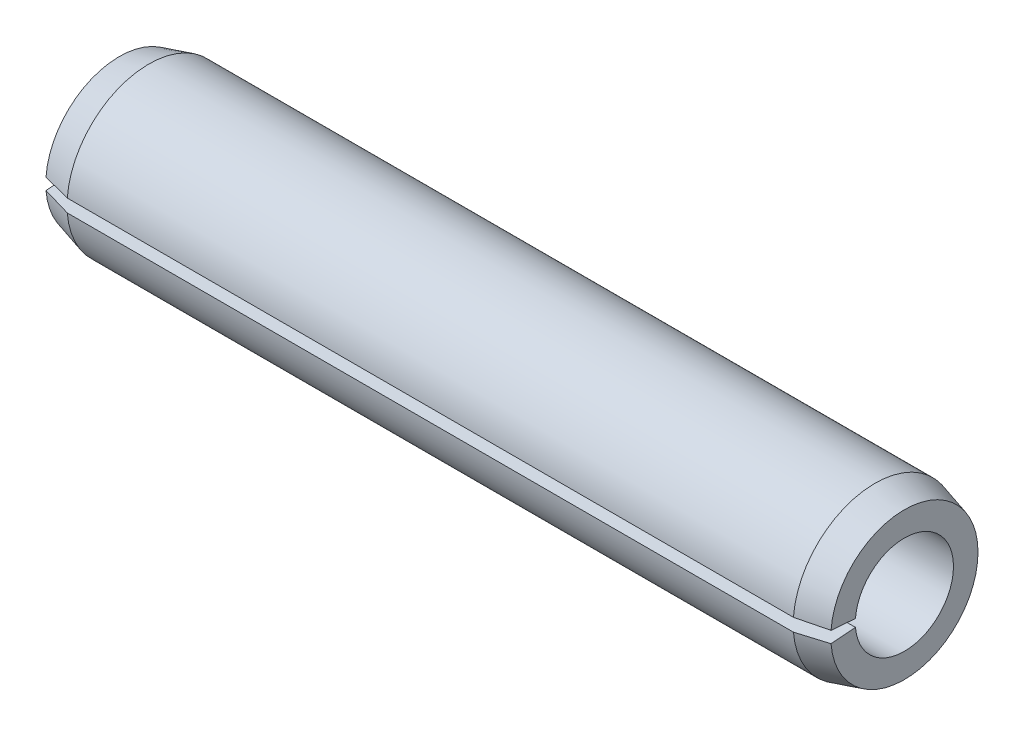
ISO-10303-21;
HEADER;
FILE_DESCRIPTION(('STEP AP214'),'2;1');
FILE_NAME('part.step','',(''),(''),'','','');
FILE_SCHEMA(('AUTOMOTIVE_DESIGN { 1 0 10303 214 1 1 1 1 }'));
ENDSEC;
DATA;
#1=APPLICATION_CONTEXT('core data for automotive mechanical design processes');
#2=APPLICATION_PROTOCOL_DEFINITION('international standard','automotive_design',2000,#1);
#3=PRODUCT_CONTEXT('',#1,'mechanical');
#4=PRODUCT('Part','Part','',(#3));
#5=PRODUCT_RELATED_PRODUCT_CATEGORY('part','',(#4));
#6=PRODUCT_DEFINITION_FORMATION('','',#4);
#7=PRODUCT_DEFINITION_CONTEXT('part definition',#1,'design');
#8=PRODUCT_DEFINITION('design','',#6,#7);
#9=PRODUCT_DEFINITION_SHAPE('','',#8);
#10=(LENGTH_UNIT() NAMED_UNIT(*) SI_UNIT(.MILLI.,.METRE.));
#11=(NAMED_UNIT(*) PLANE_ANGLE_UNIT() SI_UNIT($,.RADIAN.));
#12=(NAMED_UNIT(*) SI_UNIT($,.STERADIAN.) SOLID_ANGLE_UNIT());
#13=UNCERTAINTY_MEASURE_WITH_UNIT(LENGTH_MEASURE(1.E-05),#10,'distance_accuracy_value','');
#14=(GEOMETRIC_REPRESENTATION_CONTEXT(3) GLOBAL_UNCERTAINTY_ASSIGNED_CONTEXT((#13)) GLOBAL_UNIT_ASSIGNED_CONTEXT((#10,
#11,#12)) REPRESENTATION_CONTEXT('',''));
#15=CARTESIAN_POINT('',(0.,0.,0.));
#16=DIRECTION('',(0.,0.,1.));
#17=DIRECTION('',(1.,0.,0.));
#18=AXIS2_PLACEMENT_3D('',#15,#16,#17);
#19=CARTESIAN_POINT('',(0.,2.25,0.));
#20=DIRECTION('',(1.,0.,0.));
#21=DIRECTION('',(0.,0.,-1.00000000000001));
#22=AXIS2_PLACEMENT_3D('',#19,#20,#21);
#23=PLANE('',#22);
#24=DIRECTION('',(0.,0.0784590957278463,0.996917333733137));
#25=VECTOR('',#24,1.);
#26=CARTESIAN_POINT('',(0.,0.,0.));
#27=LINE('',#26,#25);
#28=CARTESIAN_POINT('',(0.,0.117688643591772,1.4953760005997));
#29=VERTEX_POINT('',#28);
#30=CARTESIAN_POINT('',(0.,0.176532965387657,2.24306400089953));
#31=VERTEX_POINT('',#30);
#32=EDGE_CURVE('E83',#29,#31,#27,.T.);
#33=ORIENTED_EDGE('',*,*,#32,.T.);
#34=CARTESIAN_POINT('',(0.,0.,0.));
#35=DIRECTION('',(-1.,0.,0.));
#36=DIRECTION('',(0.,0.,1.00000000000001));
#37=AXIS2_PLACEMENT_3D('',#34,#35,#36);
#38=CIRCLE('',#37,2.25);
#39=CARTESIAN_POINT('',(0.,-0.176532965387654,2.24306400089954));
#40=VERTEX_POINT('',#39);
#41=EDGE_CURVE('E101',#31,#40,#38,.T.);
#42=ORIENTED_EDGE('',*,*,#41,.T.);
#43=DIRECTION('',(0.,-0.078459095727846,0.996917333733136));
#44=VECTOR('',#43,1.);
#45=CARTESIAN_POINT('',(0.,0.,0.));
#46=LINE('',#45,#44);
#47=CARTESIAN_POINT('',(0.,-0.117688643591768,1.49537600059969));
#48=VERTEX_POINT('',#47);
#49=EDGE_CURVE('E55',#48,#40,#46,.T.);
#50=ORIENTED_EDGE('',*,*,#49,.F.);
#51=CARTESIAN_POINT('',(0.,0.,0.));
#52=DIRECTION('',(-1.,0.,0.));
#53=DIRECTION('',(0.,0.,1.00000000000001));
#54=AXIS2_PLACEMENT_3D('',#51,#52,#53);
#55=CIRCLE('',#54,1.5);
#56=EDGE_CURVE('E98',#29,#48,#55,.T.);
#57=ORIENTED_EDGE('',*,*,#56,.F.);
#58=EDGE_LOOP('',(#33,#42,#50,#57));
#59=FACE_BOUND('',#58,.T.);
#60=ADVANCED_FACE('F34',(#59),#23,.F.);
#61=CARTESIAN_POINT('',(-9.52499999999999,0.,-2.28983498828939E-13));
#62=DIRECTION('',(-1.,0.,0.));
#63=DIRECTION('',(0.,0.,1.00000000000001));
#64=AXIS2_PLACEMENT_3D('',#61,#62,#63);
#65=CYLINDRICAL_SURFACE('',#64,1.5);
#66=DIRECTION('',(-1.,0.,0.));
#67=VECTOR('',#66,1.);
#68=CARTESIAN_POINT('',(-9.52499999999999,0.117688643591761,1.49537600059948));
#69=LINE('',#68,#67);
#70=CARTESIAN_POINT('',(24.,0.117688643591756,1.49537600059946));
#71=VERTEX_POINT('',#70);
#72=EDGE_CURVE('E86',#29,#71,#69,.F.);
#73=ORIENTED_EDGE('',*,*,#72,.F.);
#74=ORIENTED_EDGE('',*,*,#56,.T.);
#75=DIRECTION('',(-1.,0.,0.));
#76=VECTOR('',#75,1.);
#77=CARTESIAN_POINT('',(-9.52499999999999,-0.117688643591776,1.49537600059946));
#78=LINE('',#77,#76);
#79=CARTESIAN_POINT('',(24.,-0.117688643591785,1.49537600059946));
#80=VERTEX_POINT('',#79);
#81=EDGE_CURVE('E119',#48,#80,#78,.F.);
#82=ORIENTED_EDGE('',*,*,#81,.T.);
#83=CARTESIAN_POINT('',(24.,0.,-2.39391839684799E-13));
#84=DIRECTION('',(-1.,0.,0.));
#85=DIRECTION('',(0.,0.,1.00000000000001));
#86=AXIS2_PLACEMENT_3D('',#83,#84,#85);
#87=CIRCLE('',#86,1.5);
#88=EDGE_CURVE('E100',#71,#80,#87,.T.);
#89=ORIENTED_EDGE('',*,*,#88,.F.);
#90=EDGE_LOOP('',(#73,#74,#82,#89));
#91=FACE_BOUND('',#90,.T.);
#92=ADVANCED_FACE('F96',(#91),#65,.F.);
#93=CARTESIAN_POINT('',(24.,1.50000000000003,-2.46330733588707E-13));
#94=DIRECTION('',(-1.,0.,0.));
#95=DIRECTION('',(0.,0.,1.00000000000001));
#96=AXIS2_PLACEMENT_3D('',#93,#94,#95);
#97=PLANE('',#96);
#98=DIRECTION('',(0.,0.0784590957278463,0.996917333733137));
#99=VECTOR('',#98,1.);
#100=CARTESIAN_POINT('',(24.,0.,-2.39391839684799E-13));
#101=LINE('',#100,#99);
#102=CARTESIAN_POINT('',(24.,0.17653296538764,2.24306400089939));
#103=VERTEX_POINT('',#102);
#104=EDGE_CURVE('E130',#71,#103,#101,.T.);
#105=ORIENTED_EDGE('',*,*,#104,.F.);
#106=ORIENTED_EDGE('',*,*,#88,.T.);
#107=DIRECTION('',(0.,-0.078459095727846,0.996917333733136));
#108=VECTOR('',#107,1.);
#109=CARTESIAN_POINT('',(24.,0.,-2.39391839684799E-13));
#110=LINE('',#109,#108);
#111=CARTESIAN_POINT('',(24.,-0.176532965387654,2.24306400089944));
#112=VERTEX_POINT('',#111);
#113=EDGE_CURVE('E127',#80,#112,#110,.T.);
#114=ORIENTED_EDGE('',*,*,#113,.T.);
#115=CARTESIAN_POINT('',(24.,0.,-2.39391839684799E-13));
#116=DIRECTION('',(-1.,0.,0.));
#117=DIRECTION('',(0.,0.,1.00000000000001));
#118=AXIS2_PLACEMENT_3D('',#115,#116,#117);
#119=CIRCLE('',#118,2.25);
#120=EDGE_CURVE('E105',#103,#112,#119,.T.);
#121=ORIENTED_EDGE('',*,*,#120,.F.);
#122=EDGE_LOOP('',(#105,#106,#114,#121));
#123=FACE_BOUND('',#122,.T.);
#124=ADVANCED_FACE('F138',(#123),#97,.F.);
#125=CARTESIAN_POINT('',(24.,0.,-2.39391839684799E-13));
#126=DIRECTION('',(-1.,0.,0.));
#127=DIRECTION('',(0.,0.,1.00000000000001));
#128=AXIS2_PLACEMENT_3D('',#125,#126,#127);
#129=CONICAL_SURFACE('',#128,2.25,0.270946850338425);
#130=DIRECTION('',(-0.96351790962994,0.0209990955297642,0.266818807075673));
#131=VECTOR('',#130,1.);
#132=CARTESIAN_POINT('',(32.0999999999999,0.,0.));
#133=LINE('',#132,#131);
#134=CARTESIAN_POINT('',(23.1,0.196147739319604,2.49229333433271));
#135=VERTEX_POINT('',#134);
#136=EDGE_CURVE('E102',#103,#135,#133,.T.);
#137=ORIENTED_EDGE('',*,*,#136,.F.);
#138=ORIENTED_EDGE('',*,*,#120,.T.);
#139=DIRECTION('',(-0.96351790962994,-0.020999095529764,0.266818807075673));
#140=VECTOR('',#139,1.);
#141=CARTESIAN_POINT('',(32.0999999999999,0.,0.));
#142=LINE('',#141,#140);
#143=CARTESIAN_POINT('',(23.1,-0.196147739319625,2.4922933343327));
#144=VERTEX_POINT('',#143);
#145=EDGE_CURVE('E121',#112,#144,#142,.T.);
#146=ORIENTED_EDGE('',*,*,#145,.T.);
#147=CARTESIAN_POINT('',(23.1,0.,-2.35922392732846E-13));
#148=DIRECTION('',(-1.,0.,0.));
#149=DIRECTION('',(0.,0.,1.00000000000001));
#150=AXIS2_PLACEMENT_3D('',#147,#148,#149);
#151=CIRCLE('',#150,2.5);
#152=EDGE_CURVE('E110',#135,#144,#151,.T.);
#153=ORIENTED_EDGE('',*,*,#152,.F.);
#154=EDGE_LOOP('',(#137,#138,#146,#153));
#155=FACE_BOUND('',#154,.T.);
#156=ADVANCED_FACE('F137',(#155),#129,.T.);
#157=CARTESIAN_POINT('',(-9.52499999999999,0.,-2.28983498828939E-13));
#158=DIRECTION('',(-1.,0.,0.));
#159=DIRECTION('',(0.,0.,1.00000000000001));
#160=AXIS2_PLACEMENT_3D('',#157,#158,#159);
#161=CYLINDRICAL_SURFACE('',#160,2.5);
#162=DIRECTION('',(-1.,0.,0.));
#163=VECTOR('',#162,1.);
#164=CARTESIAN_POINT('',(-9.52499999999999,0.196147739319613,2.49229333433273));
#165=LINE('',#164,#163);
#166=CARTESIAN_POINT('',(0.9,0.196147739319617,2.49229333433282));
#167=VERTEX_POINT('',#166);
#168=EDGE_CURVE('E47',#135,#167,#165,.T.);
#169=ORIENTED_EDGE('',*,*,#168,.F.);
#170=ORIENTED_EDGE('',*,*,#152,.T.);
#171=DIRECTION('',(-1.,0.,0.));
#172=VECTOR('',#171,1.);
#173=CARTESIAN_POINT('',(-9.52499999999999,-0.196147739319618,2.49229333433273));
#174=LINE('',#173,#172);
#175=CARTESIAN_POINT('',(0.9,-0.196147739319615,2.49229333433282));
#176=VERTEX_POINT('',#175);
#177=EDGE_CURVE('E124',#144,#176,#174,.T.);
#178=ORIENTED_EDGE('',*,*,#177,.T.);
#179=CARTESIAN_POINT('',(0.9,0.,0.));
#180=DIRECTION('',(-1.,0.,0.));
#181=DIRECTION('',(0.,0.,1.00000000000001));
#182=AXIS2_PLACEMENT_3D('',#179,#180,#181);
#183=CIRCLE('',#182,2.5);
#184=EDGE_CURVE('E113',#167,#176,#183,.T.);
#185=ORIENTED_EDGE('',*,*,#184,.F.);
#186=EDGE_LOOP('',(#169,#170,#178,#185));
#187=FACE_BOUND('',#186,.T.);
#188=ADVANCED_FACE('F141',(#187),#161,.T.);
#189=CARTESIAN_POINT('',(0.9,0.,0.));
#190=DIRECTION('',(1.,0.,0.));
#191=DIRECTION('',(0.,0.,-1.00000000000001));
#192=AXIS2_PLACEMENT_3D('',#189,#190,#191);
#193=CONICAL_SURFACE('',#192,2.5,0.270946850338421);
#194=DIRECTION('',(-0.963517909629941,-0.0209990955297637,-0.266818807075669));
#195=VECTOR('',#194,1.);
#196=CARTESIAN_POINT('',(-8.09999999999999,0.,-2.28983498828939E-13));
#197=LINE('',#196,#195);
#198=EDGE_CURVE('E11',#167,#31,#197,.T.);
#199=ORIENTED_EDGE('',*,*,#198,.F.);
#200=ORIENTED_EDGE('',*,*,#184,.T.);
#201=DIRECTION('',(-0.963517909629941,0.0209990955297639,-0.266818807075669));
#202=VECTOR('',#201,1.);
#203=CARTESIAN_POINT('',(-8.09999999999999,0.,-2.28983498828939E-13));
#204=LINE('',#203,#202);
#205=EDGE_CURVE('E41',#176,#40,#204,.T.);
#206=ORIENTED_EDGE('',*,*,#205,.T.);
#207=ORIENTED_EDGE('',*,*,#41,.F.);
#208=EDGE_LOOP('',(#199,#200,#206,#207));
#209=FACE_BOUND('',#208,.T.);
#210=ADVANCED_FACE('F144',(#209),#193,.T.);
#211=CARTESIAN_POINT('',(24.,0.,-2.39391839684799E-13));
#212=DIRECTION('',(0.,-0.996917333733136,-0.078459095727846));
#213=DIRECTION('',(0.,0.078459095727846,-0.996917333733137));
#214=AXIS2_PLACEMENT_3D('',#211,#212,#213);
#215=PLANE('',#214);
#216=ORIENTED_EDGE('',*,*,#49,.T.);
#217=ORIENTED_EDGE('',*,*,#205,.F.);
#218=ORIENTED_EDGE('',*,*,#177,.F.);
#219=ORIENTED_EDGE('',*,*,#145,.F.);
#220=ORIENTED_EDGE('',*,*,#113,.F.);
#221=ORIENTED_EDGE('',*,*,#81,.F.);
#222=EDGE_LOOP('',(#216,#217,#218,#219,#220,#221));
#223=FACE_BOUND('',#222,.T.);
#224=ADVANCED_FACE('F139',(#223),#215,.F.);
#225=CARTESIAN_POINT('',(24.,0.,-2.39391839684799E-13));
#226=DIRECTION('',(0.,-0.996917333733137,0.0784590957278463));
#227=DIRECTION('',(0.,-0.0784590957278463,-0.996917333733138));
#228=AXIS2_PLACEMENT_3D('',#225,#226,#227);
#229=PLANE('',#228);
#230=ORIENTED_EDGE('',*,*,#72,.T.);
#231=ORIENTED_EDGE('',*,*,#104,.T.);
#232=ORIENTED_EDGE('',*,*,#136,.T.);
#233=ORIENTED_EDGE('',*,*,#168,.T.);
#234=ORIENTED_EDGE('',*,*,#198,.T.);
#235=ORIENTED_EDGE('',*,*,#32,.F.);
#236=EDGE_LOOP('',(#230,#231,#232,#233,#234,#235));
#237=FACE_BOUND('',#236,.T.);
#238=ADVANCED_FACE('F85',(#237),#229,.T.);
#239=CLOSED_SHELL('',(#60,#92,#124,#156,#188,#210,#224,#238));
#240=MANIFOLD_SOLID_BREP('B2',#239);
#241=ADVANCED_BREP_SHAPE_REPRESENTATION('',(#18,#240),#14);
#242=SHAPE_DEFINITION_REPRESENTATION(#9,#241);
ENDSEC;
END-ISO-10303-21;
